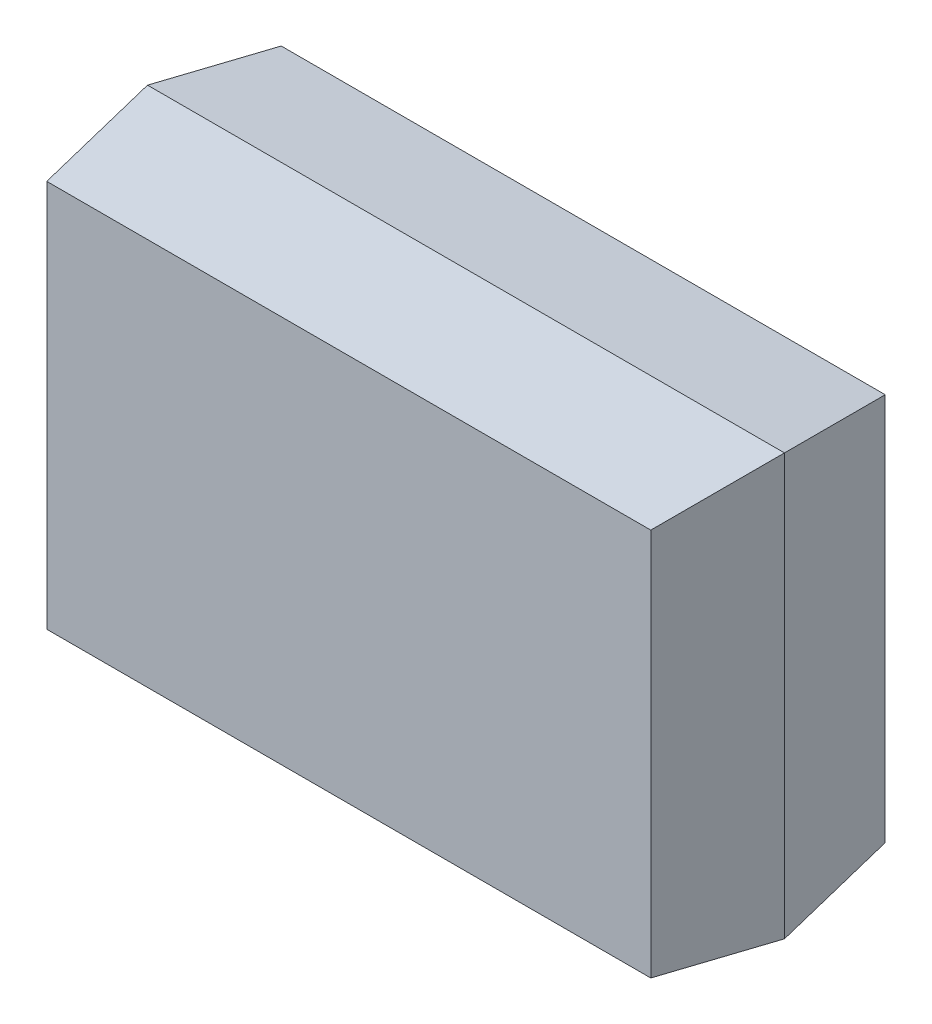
ISO-10303-21;
HEADER;
FILE_DESCRIPTION(('STEP AP214'),'2;1');
FILE_NAME('part.step','',(''),(''),'','','');
FILE_SCHEMA(('AUTOMOTIVE_DESIGN { 1 0 10303 214 1 1 1 1 }'));
ENDSEC;
DATA;
#1=APPLICATION_CONTEXT('core data for automotive mechanical design processes');
#2=APPLICATION_PROTOCOL_DEFINITION('international standard','automotive_design',2000,#1);
#3=PRODUCT_CONTEXT('',#1,'mechanical');
#4=PRODUCT('Part','Part','',(#3));
#5=PRODUCT_RELATED_PRODUCT_CATEGORY('part','',(#4));
#6=PRODUCT_DEFINITION_FORMATION('','',#4);
#7=PRODUCT_DEFINITION_CONTEXT('part definition',#1,'design');
#8=PRODUCT_DEFINITION('design','',#6,#7);
#9=PRODUCT_DEFINITION_SHAPE('','',#8);
#10=(LENGTH_UNIT() NAMED_UNIT(*) SI_UNIT(.MILLI.,.METRE.));
#11=(NAMED_UNIT(*) PLANE_ANGLE_UNIT() SI_UNIT($,.RADIAN.));
#12=(NAMED_UNIT(*) SI_UNIT($,.STERADIAN.) SOLID_ANGLE_UNIT());
#13=UNCERTAINTY_MEASURE_WITH_UNIT(LENGTH_MEASURE(1.E-05),#10,'distance_accuracy_value','');
#14=(GEOMETRIC_REPRESENTATION_CONTEXT(3) GLOBAL_UNCERTAINTY_ASSIGNED_CONTEXT((#13)) GLOBAL_UNIT_ASSIGNED_CONTEXT((#10,
#11,#12)) REPRESENTATION_CONTEXT('',''));
#15=CARTESIAN_POINT('',(0.,0.,0.));
#16=DIRECTION('',(0.,0.,1.));
#17=DIRECTION('',(1.,0.,0.));
#18=AXIS2_PLACEMENT_3D('',#15,#16,#17);
#19=CARTESIAN_POINT('',(69.1005364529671,0.,19.75));
#20=DIRECTION('',(0.990268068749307,0.,0.139173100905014));
#21=DIRECTION('',(0.139173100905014,0.,-0.990268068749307));
#22=AXIS2_PLACEMENT_3D('',#19,#20,#21);
#23=PLANE('',#22);
#24=DIRECTION('',(0.137844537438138,-0.137844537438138,-0.980814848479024));
#25=VECTOR('',#24,1.);
#26=CARTESIAN_POINT('',(68.735209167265,-18.8612947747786,22.3494387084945));
#27=LINE('',#26,#25);
#28=CARTESIAN_POINT('',(66.3248549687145,-16.4509405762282,39.5));
#29=VERTEX_POINT('',#28);
#30=CARTESIAN_POINT('',(69.1005364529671,-19.2266220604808,19.75));
#31=VERTEX_POINT('',#30);
#32=EDGE_CURVE('E125',#29,#31,#27,.T.);
#33=ORIENTED_EDGE('',*,*,#32,.T.);
#34=DIRECTION('',(0.,1.,0.));
#35=VECTOR('',#34,1.);
#36=CARTESIAN_POINT('',(69.1005364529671,0.,19.75));
#37=LINE('',#36,#35);
#38=CARTESIAN_POINT('',(69.1005364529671,51.674992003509,19.75));
#39=VERTEX_POINT('',#38);
#40=EDGE_CURVE('E12',#31,#39,#37,.T.);
#41=ORIENTED_EDGE('',*,*,#40,.T.);
#42=DIRECTION('',(0.137844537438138,0.137844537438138,-0.980814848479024));
#43=VECTOR('',#42,1.);
#44=CARTESIAN_POINT('',(67.7875491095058,50.3620046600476,29.0923903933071));
#45=LINE('',#44,#43);
#46=CARTESIAN_POINT('',(66.3248549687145,48.8993105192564,39.5));
#47=VERTEX_POINT('',#46);
#48=EDGE_CURVE('E87',#47,#39,#45,.T.);
#49=ORIENTED_EDGE('',*,*,#48,.F.);
#50=DIRECTION('',(0.,-1.,0.));
#51=VECTOR('',#50,1.);
#52=CARTESIAN_POINT('',(66.3248549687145,0.,39.5));
#53=LINE('',#52,#51);
#54=EDGE_CURVE('E111',#29,#47,#53,.F.);
#55=ORIENTED_EDGE('',*,*,#54,.F.);
#56=EDGE_LOOP('',(#33,#41,#49,#55));
#57=FACE_BOUND('',#56,.T.);
#58=ADVANCED_FACE('F32',(#57),#23,.T.);
#59=CARTESIAN_POINT('',(0.,51.674992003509,19.75));
#60=DIRECTION('',(0.,0.990268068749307,0.139173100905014));
#61=DIRECTION('',(0.,-0.139173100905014,0.990268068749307));
#62=AXIS2_PLACEMENT_3D('',#59,#60,#61);
#63=PLANE('',#62);
#64=ORIENTED_EDGE('',*,*,#48,.T.);
#65=DIRECTION('',(-1.,0.,0.));
#66=VECTOR('',#65,1.);
#67=CARTESIAN_POINT('',(0.,51.674992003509,19.75));
#68=LINE('',#67,#66);
#69=CARTESIAN_POINT('',(-38.2100145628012,51.674992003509,19.75));
#70=VERTEX_POINT('',#69);
#71=EDGE_CURVE('E42',#39,#70,#68,.T.);
#72=ORIENTED_EDGE('',*,*,#71,.T.);
#73=DIRECTION('',(-0.137844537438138,0.137844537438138,-0.980814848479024));
#74=VECTOR('',#73,1.);
#75=CARTESIAN_POINT('',(-37.2281320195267,50.6931094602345,26.7364573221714));
#76=LINE('',#75,#74);
#77=CARTESIAN_POINT('',(-35.4343330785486,48.8993105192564,39.5));
#78=VERTEX_POINT('',#77);
#79=EDGE_CURVE('E88',#78,#70,#76,.T.);
#80=ORIENTED_EDGE('',*,*,#79,.F.);
#81=DIRECTION('',(1.,0.,0.));
#82=VECTOR('',#81,1.);
#83=CARTESIAN_POINT('',(0.,48.8993105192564,39.5));
#84=LINE('',#83,#82);
#85=EDGE_CURVE('E114',#47,#78,#84,.F.);
#86=ORIENTED_EDGE('',*,*,#85,.F.);
#87=EDGE_LOOP('',(#64,#72,#80,#86));
#88=FACE_BOUND('',#87,.T.);
#89=ADVANCED_FACE('F154',(#88),#63,.T.);
#90=CARTESIAN_POINT('',(-38.2100145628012,0.,19.75));
#91=DIRECTION('',(-0.990268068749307,0.,0.139173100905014));
#92=DIRECTION('',(0.139173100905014,0.,0.990268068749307));
#93=AXIS2_PLACEMENT_3D('',#90,#91,#92);
#94=PLANE('',#93);
#95=ORIENTED_EDGE('',*,*,#79,.T.);
#96=DIRECTION('',(0.,-1.,0.));
#97=VECTOR('',#96,1.);
#98=CARTESIAN_POINT('',(-38.2100145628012,0.,19.75));
#99=LINE('',#98,#97);
#100=CARTESIAN_POINT('',(-38.2100145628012,-19.2266220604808,19.75));
#101=VERTEX_POINT('',#100);
#102=EDGE_CURVE('E131',#70,#101,#99,.T.);
#103=ORIENTED_EDGE('',*,*,#102,.T.);
#104=DIRECTION('',(-0.137844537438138,-0.137844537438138,-0.980814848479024));
#105=VECTOR('',#104,1.);
#106=CARTESIAN_POINT('',(-37.4839816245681,-18.5005891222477,24.9159927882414));
#107=LINE('',#106,#105);
#108=CARTESIAN_POINT('',(-35.4343330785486,-16.4509405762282,39.5));
#109=VERTEX_POINT('',#108);
#110=EDGE_CURVE('E120',#109,#101,#107,.T.);
#111=ORIENTED_EDGE('',*,*,#110,.F.);
#112=DIRECTION('',(0.,1.,0.));
#113=VECTOR('',#112,1.);
#114=CARTESIAN_POINT('',(-35.4343330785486,0.,39.5));
#115=LINE('',#114,#113);
#116=EDGE_CURVE('E102',#78,#109,#115,.F.);
#117=ORIENTED_EDGE('',*,*,#116,.F.);
#118=EDGE_LOOP('',(#95,#103,#111,#117));
#119=FACE_BOUND('',#118,.T.);
#120=ADVANCED_FACE('F143',(#119),#94,.T.);
#121=CARTESIAN_POINT('',(0.,-19.2266220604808,19.75));
#122=DIRECTION('',(0.,-0.990268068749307,0.139173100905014));
#123=DIRECTION('',(0.,-0.139173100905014,-0.990268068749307));
#124=AXIS2_PLACEMENT_3D('',#121,#122,#123);
#125=PLANE('',#124);
#126=ORIENTED_EDGE('',*,*,#110,.T.);
#127=DIRECTION('',(1.,0.,0.));
#128=VECTOR('',#127,1.);
#129=CARTESIAN_POINT('',(0.,-19.2266220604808,19.75));
#130=LINE('',#129,#128);
#131=EDGE_CURVE('E123',#101,#31,#130,.T.);
#132=ORIENTED_EDGE('',*,*,#131,.T.);
#133=ORIENTED_EDGE('',*,*,#32,.F.);
#134=DIRECTION('',(-1.,0.,0.));
#135=VECTOR('',#134,1.);
#136=CARTESIAN_POINT('',(0.,-16.4509405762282,39.5));
#137=LINE('',#136,#135);
#138=EDGE_CURVE('E104',#109,#29,#137,.F.);
#139=ORIENTED_EDGE('',*,*,#138,.F.);
#140=EDGE_LOOP('',(#126,#132,#133,#139));
#141=FACE_BOUND('',#140,.T.);
#142=ADVANCED_FACE('F140',(#141),#125,.T.);
#143=CARTESIAN_POINT('',(-38.2100145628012,0.,19.75));
#144=DIRECTION('',(-0.990268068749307,0.,-0.139173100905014));
#145=DIRECTION('',(-0.139173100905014,0.,0.990268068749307));
#146=AXIS2_PLACEMENT_3D('',#143,#144,#145);
#147=PLANE('',#146);
#148=ORIENTED_EDGE('',*,*,#102,.F.);
#149=DIRECTION('',(0.137844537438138,-0.137844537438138,-0.980814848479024));
#150=VECTOR('',#149,1.);
#151=CARTESIAN_POINT('',(-37.2281320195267,50.6931094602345,12.7635426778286));
#152=LINE('',#151,#150);
#153=CARTESIAN_POINT('',(-35.4343330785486,48.8993105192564,0.));
#154=VERTEX_POINT('',#153);
#155=EDGE_CURVE('E75',#70,#154,#152,.T.);
#156=ORIENTED_EDGE('',*,*,#155,.T.);
#157=DIRECTION('',(0.,1.,0.));
#158=VECTOR('',#157,1.);
#159=CARTESIAN_POINT('',(-35.4343330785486,0.,0.));
#160=LINE('',#159,#158);
#161=CARTESIAN_POINT('',(-35.4343330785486,-16.4509405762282,0.));
#162=VERTEX_POINT('',#161);
#163=EDGE_CURVE('E101',#154,#162,#160,.F.);
#164=ORIENTED_EDGE('',*,*,#163,.T.);
#165=DIRECTION('',(0.137844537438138,0.137844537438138,-0.980814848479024));
#166=VECTOR('',#165,1.);
#167=CARTESIAN_POINT('',(-37.4839816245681,-18.5005891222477,14.5840072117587));
#168=LINE('',#167,#166);
#169=EDGE_CURVE('E124',#101,#162,#168,.T.);
#170=ORIENTED_EDGE('',*,*,#169,.F.);
#171=EDGE_LOOP('',(#148,#156,#164,#170));
#172=FACE_BOUND('',#171,.T.);
#173=ADVANCED_FACE('F136',(#172),#147,.T.);
#174=CARTESIAN_POINT('',(0.,-19.2266220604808,19.75));
#175=DIRECTION('',(0.,-0.990268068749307,-0.139173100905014));
#176=DIRECTION('',(0.,0.139173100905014,-0.990268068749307));
#177=AXIS2_PLACEMENT_3D('',#174,#175,#176);
#178=PLANE('',#177);
#179=ORIENTED_EDGE('',*,*,#131,.F.);
#180=ORIENTED_EDGE('',*,*,#169,.T.);
#181=DIRECTION('',(-1.,0.,0.));
#182=VECTOR('',#181,1.);
#183=CARTESIAN_POINT('',(0.,-16.4509405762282,0.));
#184=LINE('',#183,#182);
#185=CARTESIAN_POINT('',(66.3248549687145,-16.4509405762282,0.));
#186=VERTEX_POINT('',#185);
#187=EDGE_CURVE('E98',#162,#186,#184,.F.);
#188=ORIENTED_EDGE('',*,*,#187,.T.);
#189=DIRECTION('',(-0.137844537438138,0.137844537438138,-0.980814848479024));
#190=VECTOR('',#189,1.);
#191=CARTESIAN_POINT('',(68.735209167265,-18.8612947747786,17.1505612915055));
#192=LINE('',#191,#190);
#193=EDGE_CURVE('E94',#31,#186,#192,.T.);
#194=ORIENTED_EDGE('',*,*,#193,.F.);
#195=EDGE_LOOP('',(#179,#180,#188,#194));
#196=FACE_BOUND('',#195,.T.);
#197=ADVANCED_FACE('F145',(#196),#178,.T.);
#198=CARTESIAN_POINT('',(69.1005364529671,0.,19.75));
#199=DIRECTION('',(0.990268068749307,0.,-0.139173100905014));
#200=DIRECTION('',(-0.139173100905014,0.,-0.990268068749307));
#201=AXIS2_PLACEMENT_3D('',#198,#199,#200);
#202=PLANE('',#201);
#203=ORIENTED_EDGE('',*,*,#40,.F.);
#204=ORIENTED_EDGE('',*,*,#193,.T.);
#205=DIRECTION('',(0.,-1.,0.));
#206=VECTOR('',#205,1.);
#207=CARTESIAN_POINT('',(66.3248549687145,0.,0.));
#208=LINE('',#207,#206);
#209=CARTESIAN_POINT('',(66.3248549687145,48.8993105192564,0.));
#210=VERTEX_POINT('',#209);
#211=EDGE_CURVE('E91',#186,#210,#208,.F.);
#212=ORIENTED_EDGE('',*,*,#211,.T.);
#213=DIRECTION('',(-0.137844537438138,-0.137844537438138,-0.980814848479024));
#214=VECTOR('',#213,1.);
#215=CARTESIAN_POINT('',(67.7875491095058,50.3620046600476,10.407609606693));
#216=LINE('',#215,#214);
#217=EDGE_CURVE('E81',#39,#210,#216,.T.);
#218=ORIENTED_EDGE('',*,*,#217,.F.);
#219=EDGE_LOOP('',(#203,#204,#212,#218));
#220=FACE_BOUND('',#219,.T.);
#221=ADVANCED_FACE('F92',(#220),#202,.T.);
#222=CARTESIAN_POINT('',(0.,51.674992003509,19.75));
#223=DIRECTION('',(0.,0.990268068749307,-0.139173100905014));
#224=DIRECTION('',(0.,0.139173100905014,0.990268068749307));
#225=AXIS2_PLACEMENT_3D('',#222,#223,#224);
#226=PLANE('',#225);
#227=ORIENTED_EDGE('',*,*,#71,.F.);
#228=ORIENTED_EDGE('',*,*,#217,.T.);
#229=DIRECTION('',(1.,0.,0.));
#230=VECTOR('',#229,1.);
#231=CARTESIAN_POINT('',(0.,48.8993105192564,0.));
#232=LINE('',#231,#230);
#233=EDGE_CURVE('E36',#210,#154,#232,.F.);
#234=ORIENTED_EDGE('',*,*,#233,.T.);
#235=ORIENTED_EDGE('',*,*,#155,.F.);
#236=EDGE_LOOP('',(#227,#228,#234,#235));
#237=FACE_BOUND('',#236,.T.);
#238=ADVANCED_FACE('F34',(#237),#226,.T.);
#239=CARTESIAN_POINT('',(-38.2100145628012,-19.2266220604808,39.5));
#240=DIRECTION('',(0.,0.,1.));
#241=DIRECTION('',(1.,0.,0.));
#242=AXIS2_PLACEMENT_3D('',#239,#240,#241);
#243=PLANE('',#242);
#244=ORIENTED_EDGE('',*,*,#116,.T.);
#245=ORIENTED_EDGE('',*,*,#138,.T.);
#246=ORIENTED_EDGE('',*,*,#54,.T.);
#247=ORIENTED_EDGE('',*,*,#85,.T.);
#248=EDGE_LOOP('',(#244,#245,#246,#247));
#249=FACE_BOUND('',#248,.T.);
#250=ADVANCED_FACE('F152',(#249),#243,.T.);
#251=CARTESIAN_POINT('',(-38.2100145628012,-19.2266220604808,0.));
#252=DIRECTION('',(0.,0.,1.));
#253=DIRECTION('',(1.,0.,0.));
#254=AXIS2_PLACEMENT_3D('',#251,#252,#253);
#255=PLANE('',#254);
#256=ORIENTED_EDGE('',*,*,#163,.F.);
#257=ORIENTED_EDGE('',*,*,#233,.F.);
#258=ORIENTED_EDGE('',*,*,#211,.F.);
#259=ORIENTED_EDGE('',*,*,#187,.F.);
#260=EDGE_LOOP('',(#256,#257,#258,#259));
#261=FACE_BOUND('',#260,.T.);
#262=ADVANCED_FACE('F100',(#261),#255,.F.);
#263=CLOSED_SHELL('',(#58,#89,#120,#142,#173,#197,#221,#238,#250,#262));
#264=MANIFOLD_SOLID_BREP('B2',#263);
#265=ADVANCED_BREP_SHAPE_REPRESENTATION('',(#18,#264),#14);
#266=SHAPE_DEFINITION_REPRESENTATION(#9,#265);
ENDSEC;
END-ISO-10303-21;
